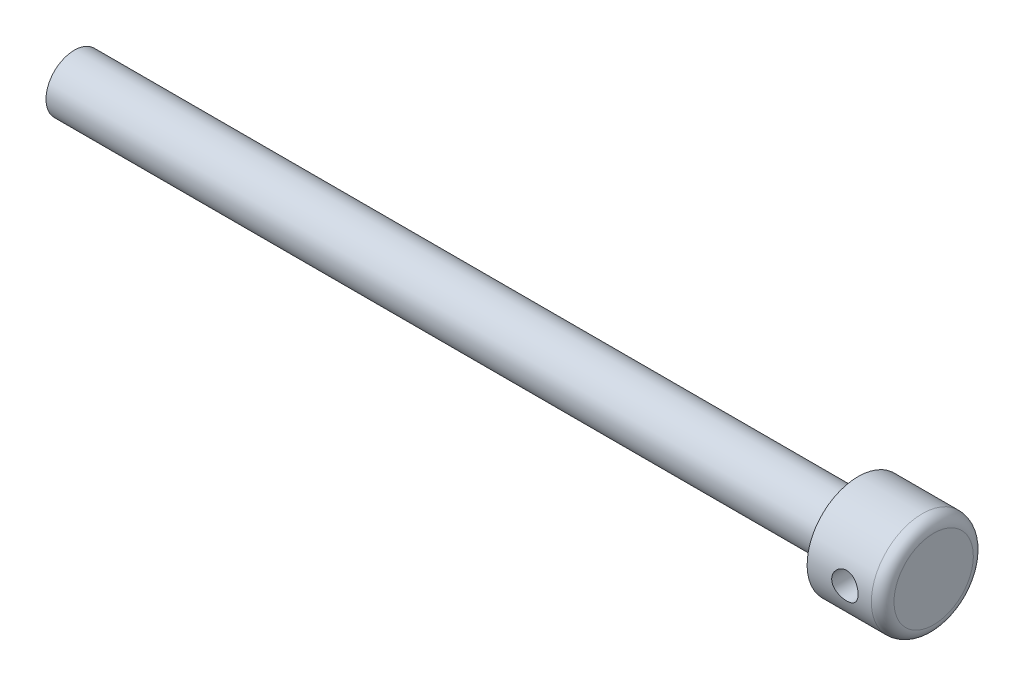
ISO-10303-21;
HEADER;
FILE_DESCRIPTION(('STEP AP214'),'2;1');
FILE_NAME('part.step','',(''),(''),'','','');
FILE_SCHEMA(('AUTOMOTIVE_DESIGN { 1 0 10303 214 1 1 1 1 }'));
ENDSEC;
DATA;
#1=APPLICATION_CONTEXT('core data for automotive mechanical design processes');
#2=APPLICATION_PROTOCOL_DEFINITION('international standard','automotive_design',2000,#1);
#3=PRODUCT_CONTEXT('',#1,'mechanical');
#4=PRODUCT('Part','Part','',(#3));
#5=PRODUCT_RELATED_PRODUCT_CATEGORY('part','',(#4));
#6=PRODUCT_DEFINITION_FORMATION('','',#4);
#7=PRODUCT_DEFINITION_CONTEXT('part definition',#1,'design');
#8=PRODUCT_DEFINITION('design','',#6,#7);
#9=PRODUCT_DEFINITION_SHAPE('','',#8);
#10=(LENGTH_UNIT() NAMED_UNIT(*) SI_UNIT(.MILLI.,.METRE.));
#11=(NAMED_UNIT(*) PLANE_ANGLE_UNIT() SI_UNIT($,.RADIAN.));
#12=(NAMED_UNIT(*) SI_UNIT($,.STERADIAN.) SOLID_ANGLE_UNIT());
#13=UNCERTAINTY_MEASURE_WITH_UNIT(LENGTH_MEASURE(1.E-05),#10,'distance_accuracy_value','');
#14=(GEOMETRIC_REPRESENTATION_CONTEXT(3) GLOBAL_UNCERTAINTY_ASSIGNED_CONTEXT((#13)) GLOBAL_UNIT_ASSIGNED_CONTEXT((#10,
#11,#12)) REPRESENTATION_CONTEXT('',''));
#15=CARTESIAN_POINT('',(0.,0.,0.));
#16=DIRECTION('',(0.,0.,1.));
#17=DIRECTION('',(1.,0.,0.));
#18=AXIS2_PLACEMENT_3D('',#15,#16,#17);
#19=CARTESIAN_POINT('',(-222.5,139.,0.));
#20=DIRECTION('',(1.,0.,0.));
#21=DIRECTION('',(0.,1.,0.));
#22=AXIS2_PLACEMENT_3D('',#19,#20,#21);
#23=CYLINDRICAL_SURFACE('',#22,15.);
#24=CARTESIAN_POINT('',(-222.5,139.,0.));
#25=DIRECTION('',(1.,0.,0.));
#26=DIRECTION('',(0.,1.,0.));
#27=AXIS2_PLACEMENT_3D('',#24,#25,#26);
#28=CIRCLE('',#27,15.);
#29=CARTESIAN_POINT('',(-222.5,154.,0.));
#30=VERTEX_POINT('',#29);
#31=EDGE_CURVE('E110',#30,#30,#28,.T.);
#32=ORIENTED_EDGE('',*,*,#31,.T.);
#33=EDGE_LOOP('',(#32));
#34=FACE_BOUND('',#33,.T.);
#35=CARTESIAN_POINT('',(192.5,139.,0.));
#36=DIRECTION('',(1.,0.,0.));
#37=DIRECTION('',(0.,1.,0.));
#38=AXIS2_PLACEMENT_3D('',#35,#36,#37);
#39=CIRCLE('',#38,15.);
#40=CARTESIAN_POINT('',(192.5,154.,0.));
#41=VERTEX_POINT('',#40);
#42=EDGE_CURVE('E112',#41,#41,#39,.T.);
#43=ORIENTED_EDGE('',*,*,#42,.F.);
#44=EDGE_LOOP('',(#43));
#45=FACE_BOUND('',#44,.T.);
#46=ADVANCED_FACE('F51',(#34,#45),#23,.T.);
#47=CARTESIAN_POINT('',(-222.5,139.,0.));
#48=DIRECTION('',(1.,0.,0.));
#49=DIRECTION('',(0.,1.,0.));
#50=AXIS2_PLACEMENT_3D('',#47,#48,#49);
#51=PLANE('',#50);
#52=ORIENTED_EDGE('',*,*,#31,.F.);
#53=EDGE_LOOP('',(#52));
#54=FACE_BOUND('',#53,.T.);
#55=ADVANCED_FACE('F102',(#54),#51,.F.);
#56=CARTESIAN_POINT('',(232.5,139.,0.));
#57=DIRECTION('',(-1.,0.,0.));
#58=DIRECTION('',(0.,-1.,0.));
#59=AXIS2_PLACEMENT_3D('',#56,#57,#58);
#60=CYLINDRICAL_SURFACE('',#59,27.);
#61=CARTESIAN_POINT('',(226.5,139.,0.));
#62=DIRECTION('',(1.,0.,0.));
#63=DIRECTION('',(0.,1.,0.));
#64=AXIS2_PLACEMENT_3D('',#61,#62,#63);
#65=CIRCLE('',#64,27.);
#66=CARTESIAN_POINT('',(226.5,166.,0.));
#67=VERTEX_POINT('',#66);
#68=EDGE_CURVE('E10',#67,#67,#65,.F.);
#69=ORIENTED_EDGE('',*,*,#68,.T.);
#70=EDGE_LOOP('',(#69));
#71=FACE_BOUND('',#70,.T.);
#72=CARTESIAN_POINT('',(219.5,139.,-27.));
#73=CARTESIAN_POINT('',(219.50000622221,139.193202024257,-27.0000038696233));
#74=CARTESIAN_POINT('',(219.492000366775,139.386337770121,-26.9979233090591));
#75=CARTESIAN_POINT('',(219.460059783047,139.771253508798,-26.9896676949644));
#76=CARTESIAN_POINT('',(219.43612342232,139.963033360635,-26.9834922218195));
#77=CARTESIAN_POINT('',(219.372509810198,140.343836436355,-26.9672107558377));
#78=CARTESIAN_POINT('',(219.332828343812,140.532858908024,-26.9571037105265));
#79=CARTESIAN_POINT('',(219.238041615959,140.906834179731,-26.9332341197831));
#80=CARTESIAN_POINT('',(219.182930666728,141.091785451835,-26.9194702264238));
#81=CARTESIAN_POINT('',(219.057838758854,141.455964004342,-26.8886887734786));
#82=CARTESIAN_POINT('',(218.987882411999,141.635200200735,-26.8716766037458));
#83=CARTESIAN_POINT('',(218.833560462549,141.987130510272,-26.8348350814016));
#84=CARTESIAN_POINT('',(218.749189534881,142.159822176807,-26.8150046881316));
#85=CARTESIAN_POINT('',(218.566698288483,142.497422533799,-26.7730638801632));
#86=CARTESIAN_POINT('',(218.46858278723,142.662333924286,-26.750954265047));
#87=CARTESIAN_POINT('',(218.259269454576,142.983415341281,-26.7050324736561));
#88=CARTESIAN_POINT('',(218.148066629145,143.139581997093,-26.681219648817));
#89=CARTESIAN_POINT('',(217.791362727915,143.599307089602,-26.6072112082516));
#90=CARTESIAN_POINT('',(217.526222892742,143.887692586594,-26.5552748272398));
#91=CARTESIAN_POINT('',(216.951442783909,144.416377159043,-26.4525184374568));
#92=CARTESIAN_POINT('',(216.641797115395,144.65667039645,-26.4016985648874));
#93=CARTESIAN_POINT('',(216.14764479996,144.977814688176,-26.3301730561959));
#94=CARTESIAN_POINT('',(215.976411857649,145.078992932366,-26.3069404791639));
#95=CARTESIAN_POINT('',(215.625739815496,145.266516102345,-26.2629026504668));
#96=CARTESIAN_POINT('',(215.446303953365,145.352866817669,-26.2420964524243));
#97=CARTESIAN_POINT('',(215.080407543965,145.510082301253,-26.2035376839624));
#98=CARTESIAN_POINT('',(214.893945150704,145.580942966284,-26.185785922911));
#99=CARTESIAN_POINT('',(214.515445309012,145.706542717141,-26.1539000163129));
#100=CARTESIAN_POINT('',(214.323410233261,145.761288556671,-26.1397643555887));
#101=CARTESIAN_POINT('',(213.939212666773,145.853237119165,-26.115806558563));
#102=CARTESIAN_POINT('',(213.74713801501,145.890784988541,-26.1058998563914));
#103=CARTESIAN_POINT('',(213.360423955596,145.949669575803,-26.0902859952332));
#104=CARTESIAN_POINT('',(213.165785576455,145.971012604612,-26.0845772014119));
#105=CARTESIAN_POINT('',(212.775319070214,145.997320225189,-26.0775323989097));
#106=CARTESIAN_POINT('',(212.579490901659,146.002284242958,-26.0761965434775));
#107=CARTESIAN_POINT('',(212.188128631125,145.995787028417,-26.0779404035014));
#108=CARTESIAN_POINT('',(211.992594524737,145.984326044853,-26.0810200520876));
#109=CARTESIAN_POINT('',(211.608441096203,145.945603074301,-26.0913584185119));
#110=CARTESIAN_POINT('',(211.419775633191,145.918766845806,-26.0985044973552));
#111=CARTESIAN_POINT('',(211.0453761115,145.849840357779,-26.1166796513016));
#112=CARTESIAN_POINT('',(210.859643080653,145.807744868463,-26.127710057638));
#113=CARTESIAN_POINT('',(210.492509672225,145.708660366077,-26.1533265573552));
#114=CARTESIAN_POINT('',(210.311107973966,145.651675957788,-26.1679115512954));
#115=CARTESIAN_POINT('',(209.95371998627,145.523229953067,-26.2002262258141));
#116=CARTESIAN_POINT('',(209.777735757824,145.451762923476,-26.2179570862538));
#117=CARTESIAN_POINT('',(209.430597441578,145.294083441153,-26.2562594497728));
#118=CARTESIAN_POINT('',(209.25951241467,145.207725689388,-26.2768585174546));
#119=CARTESIAN_POINT('',(208.925141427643,145.021381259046,-26.3201845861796));
#120=CARTESIAN_POINT('',(208.761858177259,144.921389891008,-26.3429123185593));
#121=CARTESIAN_POINT('',(208.444175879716,144.708489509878,-26.3898659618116));
#122=CARTESIAN_POINT('',(208.289776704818,144.595580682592,-26.4140918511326));
#123=CARTESIAN_POINT('',(207.990810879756,144.357585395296,-26.4633906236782));
#124=CARTESIAN_POINT('',(207.846244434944,144.232498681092,-26.4884635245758));
#125=CARTESIAN_POINT('',(207.563524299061,143.966888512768,-26.5395716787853));
#126=CARTESIAN_POINT('',(207.425707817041,143.826006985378,-26.5656126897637));
#127=CARTESIAN_POINT('',(207.162439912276,143.533123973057,-26.6171539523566));
#128=CARTESIAN_POINT('',(207.036984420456,143.381126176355,-26.6426543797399));
#129=CARTESIAN_POINT('',(206.799195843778,143.06689897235,-26.6924266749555));
#130=CARTESIAN_POINT('',(206.68686817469,142.904665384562,-26.7166980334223));
#131=CARTESIAN_POINT('',(206.476238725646,142.571159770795,-26.7633172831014));
#132=CARTESIAN_POINT('',(206.377931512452,142.399891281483,-26.7856659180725));
#133=CARTESIAN_POINT('',(206.195631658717,142.048648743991,-26.8279175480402));
#134=CARTESIAN_POINT('',(206.111702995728,141.868640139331,-26.8478095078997));
#135=CARTESIAN_POINT('',(205.959379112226,141.501935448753,-26.8844612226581));
#136=CARTESIAN_POINT('',(205.890978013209,141.315241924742,-26.9012221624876));
#137=CARTESIAN_POINT('',(205.770236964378,140.936441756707,-26.9311397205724));
#138=CARTESIAN_POINT('',(205.717897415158,140.744334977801,-26.9442962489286));
#139=CARTESIAN_POINT('',(205.629738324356,140.356140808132,-26.9666214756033));
#140=CARTESIAN_POINT('',(205.593918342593,140.160053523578,-26.9757902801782));
#141=CARTESIAN_POINT('',(205.539874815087,139.770836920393,-26.989677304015));
#142=CARTESIAN_POINT('',(205.521193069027,139.577775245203,-26.9945113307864));
#143=CARTESIAN_POINT('',(205.499910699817,139.190638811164,-27.0000211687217));
#144=CARTESIAN_POINT('',(205.497315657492,138.996563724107,-27.0006955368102));
#145=CARTESIAN_POINT('',(205.508242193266,138.608988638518,-26.997863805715));
#146=CARTESIAN_POINT('',(205.52175637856,138.41548841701,-26.9943596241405));
#147=CARTESIAN_POINT('',(205.564779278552,138.03032048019,-26.9832699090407));
#148=CARTESIAN_POINT('',(205.594293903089,137.838653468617,-26.9756828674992));
#149=CARTESIAN_POINT('',(205.668449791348,137.461754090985,-26.9567953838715));
#150=CARTESIAN_POINT('',(205.712833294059,137.276467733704,-26.9455583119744));
#151=CARTESIAN_POINT('',(205.816489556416,136.910284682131,-26.9196358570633));
#152=CARTESIAN_POINT('',(205.875767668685,136.729389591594,-26.9049492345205));
#153=CARTESIAN_POINT('',(206.008725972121,136.373315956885,-26.8725228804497));
#154=CARTESIAN_POINT('',(206.082402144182,136.198135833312,-26.8547840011));
#155=CARTESIAN_POINT('',(206.243647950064,135.8545123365,-26.8167075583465));
#156=CARTESIAN_POINT('',(206.331222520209,135.686071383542,-26.7963690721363));
#157=CARTESIAN_POINT('',(206.521379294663,135.353991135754,-26.7532273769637));
#158=CARTESIAN_POINT('',(206.624210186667,135.190499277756,-26.7303853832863));
#159=CARTESIAN_POINT('',(206.842906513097,134.872712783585,-26.6831653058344));
#160=CARTESIAN_POINT('',(206.958772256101,134.718418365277,-26.6587871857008));
#161=CARTESIAN_POINT('',(207.202800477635,134.41995117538,-26.6091347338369));
#162=CARTESIAN_POINT('',(207.33096694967,134.275781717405,-26.5838601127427));
#163=CARTESIAN_POINT('',(207.598689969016,133.998572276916,-26.5331033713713));
#164=CARTESIAN_POINT('',(207.738242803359,133.865528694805,-26.5076213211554));
#165=CARTESIAN_POINT('',(208.031800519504,133.607936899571,-26.4564427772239));
#166=CARTESIAN_POINT('',(208.186093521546,133.483714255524,-26.4307590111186));
#167=CARTESIAN_POINT('',(208.504722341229,133.24874568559,-26.3806274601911));
#168=CARTESIAN_POINT('',(208.669054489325,133.137994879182,-26.3561792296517));
#169=CARTESIAN_POINT('',(209.006783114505,132.930674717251,-26.3092112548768));
#170=CARTESIAN_POINT('',(209.180182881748,132.834110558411,-26.2866922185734));
#171=CARTESIAN_POINT('',(209.534743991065,132.655979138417,-26.2442714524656));
#172=CARTESIAN_POINT('',(209.715902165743,132.574405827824,-26.2243686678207));
#173=CARTESIAN_POINT('',(210.083754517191,132.427270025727,-26.1878777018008));
#174=CARTESIAN_POINT('',(210.27041228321,132.361620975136,-26.1712716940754));
#175=CARTESIAN_POINT('',(210.648814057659,132.246318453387,-26.1417545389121));
#176=CARTESIAN_POINT('',(210.840556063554,132.196658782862,-26.1288419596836));
#177=CARTESIAN_POINT('',(211.227782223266,132.113733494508,-26.1071096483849));
#178=CARTESIAN_POINT('',(211.423266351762,132.080467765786,-26.0982898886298));
#179=CARTESIAN_POINT('',(211.816496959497,132.030631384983,-26.0850257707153));
#180=CARTESIAN_POINT('',(212.014243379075,132.014060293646,-26.0805812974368));
#181=CARTESIAN_POINT('',(212.40429962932,131.998018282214,-26.0762787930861));
#182=CARTESIAN_POINT('',(212.596586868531,131.998030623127,-26.0762821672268));
#183=CARTESIAN_POINT('',(212.980529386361,132.013869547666,-26.0805300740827));
#184=CARTESIAN_POINT('',(213.172184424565,132.029701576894,-26.0847760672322));
#185=CARTESIAN_POINT('',(213.553332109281,132.077041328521,-26.0973799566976));
#186=CARTESIAN_POINT('',(213.74282558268,132.108542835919,-26.1057362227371));
#187=CARTESIAN_POINT('',(214.118452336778,132.186965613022,-26.1263124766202));
#188=CARTESIAN_POINT('',(214.304584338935,132.233892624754,-26.1385339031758));
#189=CARTESIAN_POINT('',(214.670784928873,132.34238057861,-26.1663756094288));
#190=CARTESIAN_POINT('',(214.850887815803,132.403832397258,-26.1819704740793));
#191=CARTESIAN_POINT('',(215.205308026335,132.541096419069,-26.2161699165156));
#192=CARTESIAN_POINT('',(215.379623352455,132.616913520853,-26.2347755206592));
#193=CARTESIAN_POINT('',(215.72127471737,132.782330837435,-26.27447087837));
#194=CARTESIAN_POINT('',(215.888611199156,132.871930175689,-26.2955604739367));
#195=CARTESIAN_POINT('',(216.21527754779,133.064290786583,-26.3396486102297));
#196=CARTESIAN_POINT('',(216.374607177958,133.167052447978,-26.3626472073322));
#197=CARTESIAN_POINT('',(216.688638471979,133.38811911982,-26.4106027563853));
#198=CARTESIAN_POINT('',(216.843084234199,133.506779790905,-26.4355965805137));
#199=CARTESIAN_POINT('',(217.141444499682,133.756449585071,-26.4862491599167));
#200=CARTESIAN_POINT('',(217.28536230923,133.88745480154,-26.5119077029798));
#201=CARTESIAN_POINT('',(217.561879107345,134.161071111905,-26.5632104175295));
#202=CARTESIAN_POINT('',(217.694471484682,134.303688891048,-26.5888545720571));
#203=CARTESIAN_POINT('',(217.947328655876,134.599493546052,-26.639407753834));
#204=CARTESIAN_POINT('',(218.067597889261,134.752676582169,-26.6643170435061));
#205=CARTESIAN_POINT('',(218.297363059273,135.071892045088,-26.7132281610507));
#206=CARTESIAN_POINT('',(218.406590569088,135.238122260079,-26.7372012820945));
#207=CARTESIAN_POINT('',(218.610581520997,135.579428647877,-26.7830044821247));
#208=CARTESIAN_POINT('',(218.705350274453,135.754501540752,-26.8048353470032));
#209=CARTESIAN_POINT('',(218.87970908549,136.112287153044,-26.8457351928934));
#210=CARTESIAN_POINT('',(218.959305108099,136.294996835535,-26.8648052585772));
#211=CARTESIAN_POINT('',(219.102702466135,136.666753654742,-26.8996443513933));
#212=CARTESIAN_POINT('',(219.166506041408,136.85579988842,-26.9154138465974));
#213=CARTESIAN_POINT('',(219.313971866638,137.363536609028,-26.9522195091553));
#214=CARTESIAN_POINT('',(219.383605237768,137.686660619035,-26.9700212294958));
#215=CARTESIAN_POINT('',(219.476611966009,138.339921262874,-26.9939076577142));
#216=CARTESIAN_POINT('',(219.499989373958,138.670057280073,-26.9999933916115));
#217=CARTESIAN_POINT('',(219.5,139.,-27.));
#218=B_SPLINE_CURVE_WITH_KNOTS('',3,(#72,#73,#74,#75,#76,#77,#78,#79,#80,#81,#82,#83,#84,#85,
#86,#87,#88,#89,#90,#91,#92,#93,#94,#95,#96,#97,#98,#99,#100,#101,#102,#103,#104,#105,#106,#107,
#108,#109,#110,#111,#112,#113,#114,#115,#116,#117,#118,#119,#120,#121,#122,#123,#124,#125,#126,
#127,#128,#129,#130,#131,#132,#133,#134,#135,#136,#137,#138,#139,#140,#141,#142,#143,#144,#145,
#146,#147,#148,#149,#150,#151,#152,#153,#154,#155,#156,#157,#158,#159,#160,#161,#162,#163,#164,
#165,#166,#167,#168,#169,#170,#171,#172,#173,#174,#175,#176,#177,#178,#179,#180,#181,#182,#183,
#184,#185,#186,#187,#188,#189,#190,#191,#192,#193,#194,#195,#196,#197,#198,#199,#200,#201,#202,
#203,#204,#205,#206,#207,#208,#209,#210,#211,#212,#213,#214,#215,#216,#217),.UNSPECIFIED.,.T.,
.F.,(4,2,2,2,2,2,2,2,2,2,2,2,2,2,2,2,2,2,2,2,2,2,2,2,2,2,2,2,2,2,2,2,2,2,2,2,2,2,2,2,2,2,2,2,2,
2,2,2,2,2,2,2,2,2,2,2,2,2,2,2,2,2,2,2,2,2,2,2,2,2,2,2,4),(0.,0.579315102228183,1.15868957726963,
1.73821925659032,2.31796284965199,2.8967527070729,3.47575684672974,4.05455855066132,
4.63358184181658,5.81331933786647,6.99319995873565,7.5933158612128,8.19319690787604,
8.79323666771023,9.39302459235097,9.9801821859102,10.5671109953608,11.1540603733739,
11.7410008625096,12.3124237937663,12.8840427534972,13.4554851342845,14.0271422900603,
14.604730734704,15.1825183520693,15.7602976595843,16.3380890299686,16.9337725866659,
17.5292593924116,18.1249910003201,18.7204911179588,19.3185757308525,19.916433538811,
20.5143062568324,21.1121630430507,21.6935256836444,22.27509000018,22.8563875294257,
23.4378999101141,24.0098124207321,24.581930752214,25.1538896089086,25.7260520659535,
26.308849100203,26.8916599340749,27.4746606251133,28.0574719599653,28.6559896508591,
29.2542898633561,29.8528086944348,30.4510854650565,31.0460334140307,31.6407504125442,
32.2354633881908,32.8301607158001,33.4063277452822,33.9826931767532,34.558830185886,
35.1351819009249,35.7073339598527,36.2796814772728,36.8519926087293,37.4243206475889,
38.0127331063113,38.600959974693,39.1895279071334,39.7778830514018,40.378188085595,
40.9782720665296,41.578119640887,42.1778820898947,43.1672999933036,44.1566312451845),.UNSPECIFIED.);
#219=CARTESIAN_POINT('',(219.5,139.,-27.));
#220=VERTEX_POINT('',#219);
#221=EDGE_CURVE('E64',#220,#220,#218,.T.);
#222=ORIENTED_EDGE('',*,*,#221,.T.);
#223=EDGE_LOOP('',(#222));
#224=FACE_BOUND('',#223,.T.);
#225=CARTESIAN_POINT('',(219.5,139.,27.));
#226=CARTESIAN_POINT('',(219.50000622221,138.806797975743,27.0000038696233));
#227=CARTESIAN_POINT('',(219.492000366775,138.613662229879,26.9979233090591));
#228=CARTESIAN_POINT('',(219.460059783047,138.228746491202,26.9896676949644));
#229=CARTESIAN_POINT('',(219.43612342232,138.036966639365,26.9834922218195));
#230=CARTESIAN_POINT('',(219.372509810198,137.656163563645,26.9672107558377));
#231=CARTESIAN_POINT('',(219.332828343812,137.467141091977,26.9571037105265));
#232=CARTESIAN_POINT('',(219.238041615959,137.093165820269,26.9332341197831));
#233=CARTESIAN_POINT('',(219.182930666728,136.908214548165,26.9194702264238));
#234=CARTESIAN_POINT('',(219.057838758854,136.544035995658,26.8886887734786));
#235=CARTESIAN_POINT('',(218.987882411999,136.364799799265,26.8716766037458));
#236=CARTESIAN_POINT('',(218.833560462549,136.012869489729,26.8348350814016));
#237=CARTESIAN_POINT('',(218.749189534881,135.840177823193,26.8150046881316));
#238=CARTESIAN_POINT('',(218.566698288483,135.502577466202,26.7730638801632));
#239=CARTESIAN_POINT('',(218.46858278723,135.337666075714,26.750954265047));
#240=CARTESIAN_POINT('',(218.259269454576,135.016584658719,26.7050324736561));
#241=CARTESIAN_POINT('',(218.148066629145,134.860418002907,26.681219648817));
#242=CARTESIAN_POINT('',(217.791362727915,134.400692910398,26.6072112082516));
#243=CARTESIAN_POINT('',(217.526222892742,134.112307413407,26.5552748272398));
#244=CARTESIAN_POINT('',(216.951442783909,133.583622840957,26.4525184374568));
#245=CARTESIAN_POINT('',(216.641797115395,133.34332960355,26.4016985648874));
#246=CARTESIAN_POINT('',(216.14764479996,133.022185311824,26.3301730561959));
#247=CARTESIAN_POINT('',(215.976411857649,132.921007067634,26.3069404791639));
#248=CARTESIAN_POINT('',(215.625739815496,132.733483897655,26.2629026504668));
#249=CARTESIAN_POINT('',(215.446303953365,132.647133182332,26.2420964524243));
#250=CARTESIAN_POINT('',(215.080407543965,132.489917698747,26.2035376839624));
#251=CARTESIAN_POINT('',(214.893945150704,132.419057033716,26.185785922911));
#252=CARTESIAN_POINT('',(214.515445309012,132.293457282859,26.1539000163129));
#253=CARTESIAN_POINT('',(214.323410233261,132.238711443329,26.1397643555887));
#254=CARTESIAN_POINT('',(213.939212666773,132.146762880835,26.115806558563));
#255=CARTESIAN_POINT('',(213.74713801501,132.109215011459,26.1058998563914));
#256=CARTESIAN_POINT('',(213.360423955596,132.050330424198,26.0902859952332));
#257=CARTESIAN_POINT('',(213.165785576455,132.028987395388,26.0845772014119));
#258=CARTESIAN_POINT('',(212.775319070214,132.002679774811,26.0775323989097));
#259=CARTESIAN_POINT('',(212.579490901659,131.997715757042,26.0761965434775));
#260=CARTESIAN_POINT('',(212.188128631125,132.004212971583,26.0779404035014));
#261=CARTESIAN_POINT('',(211.992594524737,132.015673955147,26.0810200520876));
#262=CARTESIAN_POINT('',(211.608441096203,132.054396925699,26.0913584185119));
#263=CARTESIAN_POINT('',(211.419775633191,132.081233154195,26.0985044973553));
#264=CARTESIAN_POINT('',(211.0453761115,132.150159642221,26.1166796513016));
#265=CARTESIAN_POINT('',(210.859643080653,132.192255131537,26.127710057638));
#266=CARTESIAN_POINT('',(210.492509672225,132.291339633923,26.1533265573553));
#267=CARTESIAN_POINT('',(210.311107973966,132.348324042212,26.1679115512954));
#268=CARTESIAN_POINT('',(209.95371998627,132.476770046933,26.2002262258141));
#269=CARTESIAN_POINT('',(209.777735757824,132.548237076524,26.2179570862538));
#270=CARTESIAN_POINT('',(209.430597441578,132.705916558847,26.2562594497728));
#271=CARTESIAN_POINT('',(209.25951241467,132.792274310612,26.2768585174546));
#272=CARTESIAN_POINT('',(208.925141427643,132.978618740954,26.3201845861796));
#273=CARTESIAN_POINT('',(208.761858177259,133.078610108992,26.3429123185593));
#274=CARTESIAN_POINT('',(208.444175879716,133.291510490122,26.3898659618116));
#275=CARTESIAN_POINT('',(208.289776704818,133.404419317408,26.4140918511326));
#276=CARTESIAN_POINT('',(207.990810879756,133.642414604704,26.4633906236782));
#277=CARTESIAN_POINT('',(207.846244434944,133.767501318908,26.4884635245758));
#278=CARTESIAN_POINT('',(207.563524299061,134.033111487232,26.5395716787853));
#279=CARTESIAN_POINT('',(207.425707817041,134.173993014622,26.5656126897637));
#280=CARTESIAN_POINT('',(207.162439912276,134.466876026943,26.6171539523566));
#281=CARTESIAN_POINT('',(207.036984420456,134.618873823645,26.6426543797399));
#282=CARTESIAN_POINT('',(206.799195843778,134.93310102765,26.6924266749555));
#283=CARTESIAN_POINT('',(206.68686817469,135.095334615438,26.7166980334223));
#284=CARTESIAN_POINT('',(206.476238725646,135.428840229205,26.7633172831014));
#285=CARTESIAN_POINT('',(206.377931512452,135.600108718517,26.7856659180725));
#286=CARTESIAN_POINT('',(206.195631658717,135.951351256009,26.8279175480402));
#287=CARTESIAN_POINT('',(206.111702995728,136.13135986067,26.8478095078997));
#288=CARTESIAN_POINT('',(205.959379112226,136.498064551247,26.8844612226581));
#289=CARTESIAN_POINT('',(205.890978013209,136.684758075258,26.9012221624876));
#290=CARTESIAN_POINT('',(205.770236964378,137.063558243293,26.9311397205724));
#291=CARTESIAN_POINT('',(205.717897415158,137.255665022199,26.9442962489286));
#292=CARTESIAN_POINT('',(205.629738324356,137.643859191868,26.9666214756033));
#293=CARTESIAN_POINT('',(205.593918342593,137.839946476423,26.9757902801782));
#294=CARTESIAN_POINT('',(205.539874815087,138.229163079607,26.989677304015));
#295=CARTESIAN_POINT('',(205.521193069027,138.422224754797,26.9945113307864));
#296=CARTESIAN_POINT('',(205.499910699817,138.809361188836,27.0000211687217));
#297=CARTESIAN_POINT('',(205.497315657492,139.003436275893,27.0006955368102));
#298=CARTESIAN_POINT('',(205.508242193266,139.391011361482,26.997863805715));
#299=CARTESIAN_POINT('',(205.52175637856,139.58451158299,26.9943596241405));
#300=CARTESIAN_POINT('',(205.564779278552,139.969679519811,26.9832699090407));
#301=CARTESIAN_POINT('',(205.594293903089,140.161346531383,26.9756828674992));
#302=CARTESIAN_POINT('',(205.668449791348,140.538245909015,26.9567953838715));
#303=CARTESIAN_POINT('',(205.712833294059,140.723532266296,26.9455583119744));
#304=CARTESIAN_POINT('',(205.816489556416,141.08971531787,26.9196358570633));
#305=CARTESIAN_POINT('',(205.875767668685,141.270610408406,26.9049492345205));
#306=CARTESIAN_POINT('',(206.008725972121,141.626684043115,26.8725228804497));
#307=CARTESIAN_POINT('',(206.082402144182,141.801864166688,26.8547840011));
#308=CARTESIAN_POINT('',(206.243647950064,142.1454876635,26.8167075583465));
#309=CARTESIAN_POINT('',(206.331222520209,142.313928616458,26.7963690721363));
#310=CARTESIAN_POINT('',(206.521379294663,142.646008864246,26.7532273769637));
#311=CARTESIAN_POINT('',(206.624210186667,142.809500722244,26.7303853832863));
#312=CARTESIAN_POINT('',(206.842906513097,143.127287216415,26.6831653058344));
#313=CARTESIAN_POINT('',(206.958772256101,143.281581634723,26.6587871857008));
#314=CARTESIAN_POINT('',(207.202800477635,143.58004882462,26.6091347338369));
#315=CARTESIAN_POINT('',(207.33096694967,143.724218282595,26.5838601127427));
#316=CARTESIAN_POINT('',(207.598689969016,144.001427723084,26.5331033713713));
#317=CARTESIAN_POINT('',(207.738242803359,144.134471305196,26.5076213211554));
#318=CARTESIAN_POINT('',(208.031800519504,144.392063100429,26.4564427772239));
#319=CARTESIAN_POINT('',(208.186093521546,144.516285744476,26.4307590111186));
#320=CARTESIAN_POINT('',(208.504722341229,144.75125431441,26.3806274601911));
#321=CARTESIAN_POINT('',(208.669054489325,144.862005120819,26.3561792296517));
#322=CARTESIAN_POINT('',(209.006783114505,145.069325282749,26.3092112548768));
#323=CARTESIAN_POINT('',(209.180182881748,145.165889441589,26.2866922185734));
#324=CARTESIAN_POINT('',(209.534743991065,145.344020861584,26.2442714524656));
#325=CARTESIAN_POINT('',(209.715902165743,145.425594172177,26.2243686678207));
#326=CARTESIAN_POINT('',(210.083754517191,145.572729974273,26.1878777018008));
#327=CARTESIAN_POINT('',(210.27041228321,145.638379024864,26.1712716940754));
#328=CARTESIAN_POINT('',(210.648814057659,145.753681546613,26.1417545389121));
#329=CARTESIAN_POINT('',(210.840556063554,145.803341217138,26.1288419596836));
#330=CARTESIAN_POINT('',(211.227782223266,145.886266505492,26.1071096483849));
#331=CARTESIAN_POINT('',(211.423266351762,145.919532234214,26.0982898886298));
#332=CARTESIAN_POINT('',(211.816496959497,145.969368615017,26.0850257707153));
#333=CARTESIAN_POINT('',(212.014243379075,145.985939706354,26.0805812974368));
#334=CARTESIAN_POINT('',(212.40429962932,146.001981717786,26.0762787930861));
#335=CARTESIAN_POINT('',(212.596586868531,146.001969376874,26.0762821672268));
#336=CARTESIAN_POINT('',(212.980529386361,145.986130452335,26.0805300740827));
#337=CARTESIAN_POINT('',(213.172184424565,145.970298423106,26.0847760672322));
#338=CARTESIAN_POINT('',(213.553332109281,145.922958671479,26.0973799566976));
#339=CARTESIAN_POINT('',(213.74282558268,145.891457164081,26.1057362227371));
#340=CARTESIAN_POINT('',(214.118452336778,145.813034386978,26.1263124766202));
#341=CARTESIAN_POINT('',(214.304584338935,145.766107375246,26.1385339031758));
#342=CARTESIAN_POINT('',(214.670784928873,145.65761942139,26.1663756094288));
#343=CARTESIAN_POINT('',(214.850887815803,145.596167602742,26.1819704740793));
#344=CARTESIAN_POINT('',(215.205308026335,145.458903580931,26.2161699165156));
#345=CARTESIAN_POINT('',(215.379623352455,145.383086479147,26.2347755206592));
#346=CARTESIAN_POINT('',(215.72127471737,145.217669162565,26.27447087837));
#347=CARTESIAN_POINT('',(215.888611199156,145.128069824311,26.2955604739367));
#348=CARTESIAN_POINT('',(216.21527754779,144.935709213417,26.3396486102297));
#349=CARTESIAN_POINT('',(216.374607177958,144.832947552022,26.3626472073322));
#350=CARTESIAN_POINT('',(216.688638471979,144.611880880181,26.4106027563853));
#351=CARTESIAN_POINT('',(216.843084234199,144.493220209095,26.4355965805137));
#352=CARTESIAN_POINT('',(217.141444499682,144.243550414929,26.4862491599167));
#353=CARTESIAN_POINT('',(217.28536230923,144.112545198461,26.5119077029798));
#354=CARTESIAN_POINT('',(217.561879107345,143.838928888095,26.5632104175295));
#355=CARTESIAN_POINT('',(217.694471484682,143.696311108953,26.5888545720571));
#356=CARTESIAN_POINT('',(217.947328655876,143.400506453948,26.639407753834));
#357=CARTESIAN_POINT('',(218.067597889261,143.247323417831,26.6643170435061));
#358=CARTESIAN_POINT('',(218.297363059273,142.928107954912,26.7132281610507));
#359=CARTESIAN_POINT('',(218.406590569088,142.761877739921,26.7372012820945));
#360=CARTESIAN_POINT('',(218.610581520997,142.420571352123,26.7830044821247));
#361=CARTESIAN_POINT('',(218.705350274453,142.245498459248,26.8048353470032));
#362=CARTESIAN_POINT('',(218.87970908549,141.887712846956,26.8457351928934));
#363=CARTESIAN_POINT('',(218.959305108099,141.705003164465,26.8648052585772));
#364=CARTESIAN_POINT('',(219.102702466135,141.333246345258,26.8996443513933));
#365=CARTESIAN_POINT('',(219.166506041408,141.14420011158,26.9154138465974));
#366=CARTESIAN_POINT('',(219.313971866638,140.636463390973,26.9522195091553));
#367=CARTESIAN_POINT('',(219.383605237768,140.313339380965,26.9700212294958));
#368=CARTESIAN_POINT('',(219.476611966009,139.660078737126,26.9939076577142));
#369=CARTESIAN_POINT('',(219.499989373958,139.329942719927,26.9999933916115));
#370=CARTESIAN_POINT('',(219.5,139.,27.));
#371=B_SPLINE_CURVE_WITH_KNOTS('',3,(#225,#226,#227,#228,#229,#230,#231,#232,#233,#234,#235,
#236,#237,#238,#239,#240,#241,#242,#243,#244,#245,#246,#247,#248,#249,#250,#251,#252,#253,#254,
#255,#256,#257,#258,#259,#260,#261,#262,#263,#264,#265,#266,#267,#268,#269,#270,#271,#272,#273,
#274,#275,#276,#277,#278,#279,#280,#281,#282,#283,#284,#285,#286,#287,#288,#289,#290,#291,#292,
#293,#294,#295,#296,#297,#298,#299,#300,#301,#302,#303,#304,#305,#306,#307,#308,#309,#310,#311,
#312,#313,#314,#315,#316,#317,#318,#319,#320,#321,#322,#323,#324,#325,#326,#327,#328,#329,#330,
#331,#332,#333,#334,#335,#336,#337,#338,#339,#340,#341,#342,#343,#344,#345,#346,#347,#348,#349,
#350,#351,#352,#353,#354,#355,#356,#357,#358,#359,#360,#361,#362,#363,#364,#365,#366,#367,#368,
#369,#370),.UNSPECIFIED.,.T.,.F.,(4,2,2,2,2,2,2,2,2,2,2,2,2,2,2,2,2,2,2,2,2,2,2,2,2,2,2,2,2,2,2,
2,2,2,2,2,2,2,2,2,2,2,2,2,2,2,2,2,2,2,2,2,2,2,2,2,2,2,2,2,2,2,2,2,2,2,2,2,2,2,2,2,4),(0.,
0.579315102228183,1.15868957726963,1.73821925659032,2.31796284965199,2.8967527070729,
3.47575684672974,4.05455855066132,4.63358184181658,5.81331933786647,6.99319995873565,
7.5933158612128,8.19319690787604,8.79323666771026,9.39302459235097,9.9801821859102,
10.5671109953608,11.1540603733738,11.7410008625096,12.3124237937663,12.8840427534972,
13.4554851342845,14.0271422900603,14.604730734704,15.1825183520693,15.7602976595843,
16.3380890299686,16.9337725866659,17.5292593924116,18.1249910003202,18.7204911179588,
19.3185757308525,19.916433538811,20.5143062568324,21.1121630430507,21.6935256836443,
22.27509000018,22.8563875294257,23.4378999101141,24.0098124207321,24.581930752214,
25.1538896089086,25.7260520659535,26.308849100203,26.8916599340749,27.4746606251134,
28.0574719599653,28.6559896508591,29.2542898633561,29.8528086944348,30.4510854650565,
31.0460334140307,31.6407504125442,32.2354633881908,32.8301607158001,33.4063277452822,
33.9826931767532,34.558830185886,35.1351819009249,35.7073339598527,36.2796814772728,
36.8519926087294,37.4243206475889,38.0127331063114,38.600959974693,39.1895279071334,
39.7778830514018,40.378188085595,40.9782720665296,41.578119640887,42.1778820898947,
43.1672999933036,44.1566312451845),.UNSPECIFIED.);
#372=CARTESIAN_POINT('',(219.5,139.,27.));
#373=VERTEX_POINT('',#372);
#374=EDGE_CURVE('E69',#373,#373,#371,.T.);
#375=ORIENTED_EDGE('',*,*,#374,.T.);
#376=EDGE_LOOP('',(#375));
#377=FACE_BOUND('',#376,.T.);
#378=CARTESIAN_POINT('',(192.5,139.,0.));
#379=DIRECTION('',(1.,0.,0.));
#380=DIRECTION('',(0.,1.,0.));
#381=AXIS2_PLACEMENT_3D('',#378,#379,#380);
#382=CIRCLE('',#381,27.);
#383=CARTESIAN_POINT('',(192.5,166.,0.));
#384=VERTEX_POINT('',#383);
#385=EDGE_CURVE('E114',#384,#384,#382,.T.);
#386=ORIENTED_EDGE('',*,*,#385,.T.);
#387=EDGE_LOOP('',(#386));
#388=FACE_BOUND('',#387,.T.);
#389=ADVANCED_FACE('F81',(#71,#224,#377,#388),#60,.T.);
#390=CARTESIAN_POINT('',(232.5,139.,0.));
#391=DIRECTION('',(1.,0.,0.));
#392=DIRECTION('',(0.,1.,0.));
#393=AXIS2_PLACEMENT_3D('',#390,#391,#392);
#394=PLANE('',#393);
#395=CARTESIAN_POINT('',(232.5,139.,0.));
#396=DIRECTION('',(1.,0.,0.));
#397=DIRECTION('',(0.,1.,0.));
#398=AXIS2_PLACEMENT_3D('',#395,#396,#397);
#399=CIRCLE('',#398,21.);
#400=CARTESIAN_POINT('',(232.5,160.,0.));
#401=VERTEX_POINT('',#400);
#402=EDGE_CURVE('E59',#401,#401,#399,.T.);
#403=ORIENTED_EDGE('',*,*,#402,.T.);
#404=EDGE_LOOP('',(#403));
#405=FACE_BOUND('',#404,.T.);
#406=ADVANCED_FACE('F91',(#405),#394,.T.);
#407=CARTESIAN_POINT('',(192.5,139.,0.));
#408=DIRECTION('',(1.,0.,0.));
#409=DIRECTION('',(0.,1.,0.));
#410=AXIS2_PLACEMENT_3D('',#407,#408,#409);
#411=PLANE('',#410);
#412=ORIENTED_EDGE('',*,*,#42,.T.);
#413=EDGE_LOOP('',(#412));
#414=FACE_BOUND('',#413,.T.);
#415=ORIENTED_EDGE('',*,*,#385,.F.);
#416=EDGE_LOOP('',(#415));
#417=FACE_BOUND('',#416,.T.);
#418=ADVANCED_FACE('F89',(#414,#417),#411,.F.);
#419=CARTESIAN_POINT('',(212.5,139.,-27.));
#420=DIRECTION('',(0.,0.,1.));
#421=DIRECTION('',(1.,0.,0.));
#422=AXIS2_PLACEMENT_3D('',#419,#420,#421);
#423=CYLINDRICAL_SURFACE('',#422,7.00000000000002);
#424=ORIENTED_EDGE('',*,*,#374,.F.);
#425=EDGE_LOOP('',(#424));
#426=FACE_BOUND('',#425,.T.);
#427=ORIENTED_EDGE('',*,*,#221,.F.);
#428=EDGE_LOOP('',(#427));
#429=FACE_BOUND('',#428,.T.);
#430=ADVANCED_FACE('F85',(#426,#429),#423,.F.);
#431=CARTESIAN_POINT('',(226.5,139.,0.));
#432=DIRECTION('',(1.,0.,0.));
#433=DIRECTION('',(0.,1.,0.));
#434=AXIS2_PLACEMENT_3D('',#431,#432,#433);
#435=TOROIDAL_SURFACE('',#434,21.,6.);
#436=ORIENTED_EDGE('',*,*,#68,.F.);
#437=EDGE_LOOP('',(#436));
#438=FACE_BOUND('',#437,.T.);
#439=ORIENTED_EDGE('',*,*,#402,.F.);
#440=EDGE_LOOP('',(#439));
#441=FACE_BOUND('',#440,.T.);
#442=ADVANCED_FACE('F53',(#438,#441),#435,.T.);
#443=CLOSED_SHELL('',(#46,#55,#389,#406,#418,#430,#442));
#444=MANIFOLD_SOLID_BREP('B2',#443);
#445=ADVANCED_BREP_SHAPE_REPRESENTATION('',(#18,#444),#14);
#446=SHAPE_DEFINITION_REPRESENTATION(#9,#445);
ENDSEC;
END-ISO-10303-21;
